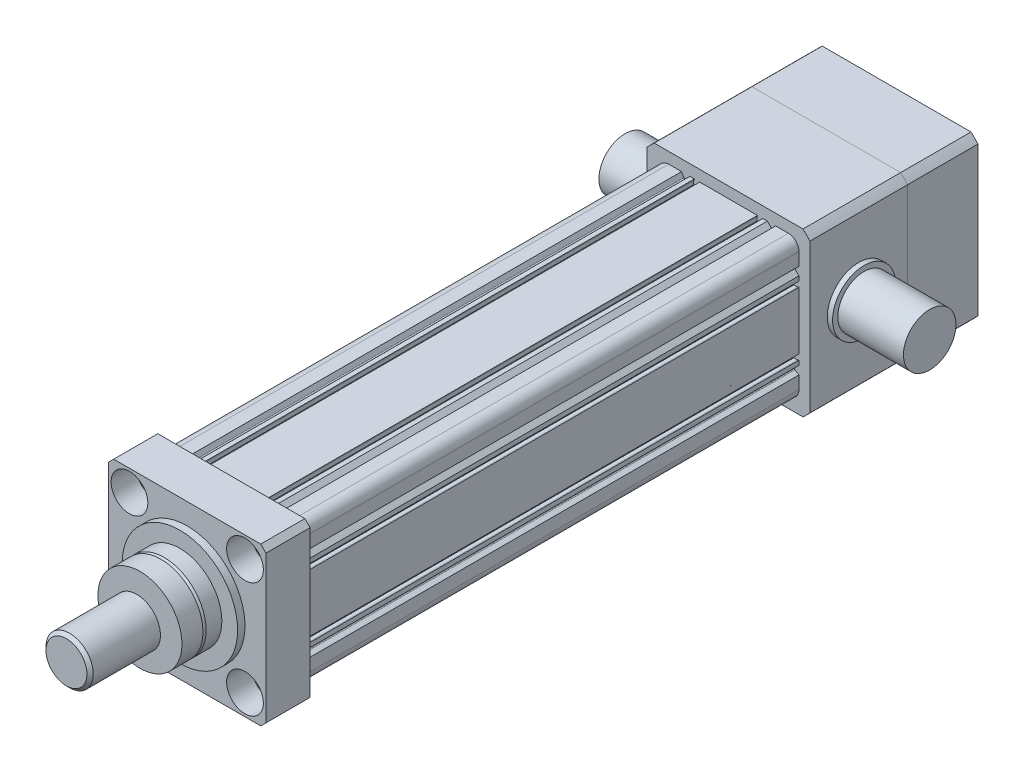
from build123d import *

# Parameters (mm, degrees)
SKETCH_1_R          = 6
EXTRUDE_1_DEPTH     = 473.5
EXTRUDE_1_2_DEPTH   = 42
SKETCH_3_R          = 6.5
SKETCH_3_R_2        = 8.5
CUT_EXTRUDE_1_DEPTH = 42
SKETCH_3_3_R        = 17.5
SKETCH_3_3_R_2      = 8.5
CUT_EXTRUDE_2_DEPTH = 24
SKETCH_3_4_R        = 55
EXTRUDE_2_DEPTH     = 7
SKETCH_4_R          = 40
EXTRUDE_3_DEPTH     = 18
CHAMFER_1_SIZE      = 3
CHAMFER_1_SIZE2     = 1.091910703
SKETCH_5_R          = 40
EXTRUDE_4_DEPTH     = 20
SKETCH_6_R          = 16.5
EXTRUDE_5_DEPTH     = 3
SKETCH_7_R          = 22.5
EXTRUDE_6_DEPTH     = 67
FILLET_1_R          = 1
CHAMFER_2_SIZE      = 3
EXTRUDE_7_DEPTH     = 93
EXTRUDE_8_DEPTH     = 67
SKETCH_10_R         = 65
CUT_EXTRUDE_3_DEPTH = 19
SKETCH_11_R         = 47
CUT_EXTRUDE_4_DEPTH = 47
SKETCH_12_R         = 25
EXTRUDE_9_DEPTH     = 67.5
EXTRUDE_START       = -222.5
SKETCH_12_2_R       = 25
EXTRUDE_10_DEPTH    = 67.5
SKETCH_13_R         = 30
SKETCH_13_R_2       = 25
EXTRUDE_11_DEPTH    = 5
EXTRUDE_START_2     = -160
SKETCH_13_2_R       = 30
SKETCH_13_2_R_2     = 25
EXTRUDE_12_DEPTH    = 5


with BuildPart() as part:
    # Sketch 1 → Extrude 1 (new body)
    with BuildSketch(Plane.XY):
        with BuildLine():
            Line((57, 67), (44.8, 67))
            Line((44.8, 67), (42.56486134, 63.12862628))
            ThreePointArc((42.56486134, 63.12862628), (41.829362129, 62.637181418), (40.991729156, 62.921519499))
            Line((40.991729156, 62.921519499), (36.913248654, 67))
            Line((36.913248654, 67), (32.6, 67))
            Line((32.6, 67), (32.6, 66.1))
            Line((32.6, 66.1), (33.2, 65.5))
            Line((33.2, 65.5), (33.2, 62))
            Line((33.2, 62), (26.9, 62))
            Line((26.9, 62), (26.9, 65.5))
            Line((26.9, 65.5), (27.5, 66.1))
            Line((27.5, 66.1), (27.5, 67))
            Line((27.5, 67), (0, 67))
            Line((0, 67), (-27.5, 67))
            Line((-27.5, 67), (-27.5, 66.1))
            Line((-27.5, 66.1), (-26.9, 65.5))
            Line((-26.9, 65.5), (-26.9, 62))
            Line((-26.9, 62), (-33.2, 62))
            Line((-33.2, 62), (-33.2, 65.5))
            Line((-33.2, 65.5), (-32.6, 66.1))
            Line((-32.6, 66.1), (-32.6, 67))
            Line((-32.6, 67), (-36.913248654, 67))
            Line((-36.913248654, 67), (-40.991729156, 62.921519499))
            ThreePointArc((-40.991729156, 62.921519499), (-41.829362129, 62.637181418), (-42.56486134, 63.12862628))
            Line((-42.56486134, 63.12862628), (-44.8, 67))
            Line((-44.8, 67), (-57, 67))
            ThreePointArc((-57, 67), (-64.071067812, 64.071067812), (-67, 57))
            Line((-67, 57), (-67, 44.8))
            Line((-67, 44.8), (-63.12862628, 42.56486134))
            ThreePointArc((-63.12862628, 42.56486134), (-62.637181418, 41.829362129), (-62.921519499, 40.991729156))
            Line((-62.921519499, 40.991729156), (-67, 36.913248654))
            Line((-67, 36.913248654), (-67, 32.6))
            Line((-67, 32.6), (-66.1, 32.6))
            Line((-66.1, 32.6), (-65.5, 33.2))
            Line((-65.5, 33.2), (-62, 33.2))
            Line((-62, 33.2), (-62, 26.9))
            Line((-62, 26.9), (-65.5, 26.9))
            Line((-65.5, 26.9), (-66.1, 27.5))
            Line((-66.1, 27.5), (-67, 27.5))
            Line((-67, 27.5), (-67, 0))
            Line((-67, 0), (-67, -27.5))
            Line((-67, -27.5), (-66.1, -27.5))
            Line((-66.1, -27.5), (-65.5, -26.9))
            Line((-65.5, -26.9), (-62, -26.9))
            Line((-62, -26.9), (-62, -33.2))
            Line((-62, -33.2), (-65.5, -33.2))
            Line((-65.5, -33.2), (-66.1, -32.6))
            Line((-66.1, -32.6), (-67, -32.6))
            Line((-67, -32.6), (-67, -36.913248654))
            Line((-67, -36.913248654), (-62.921519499, -40.991729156))
            ThreePointArc((-62.921519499, -40.991729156), (-62.637181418, -41.829362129), (-63.12862628, -42.56486134))
            Line((-63.12862628, -42.56486134), (-67, -44.8))
            Line((-67, -44.8), (-67, -57))
            ThreePointArc((-67, -57), (-64.071067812, -64.071067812), (-57, -67))
            Line((-57, -67), (-44.8, -67))
            Line((-44.8, -67), (-42.56486134, -63.12862628))
            ThreePointArc((-42.56486134, -63.12862628), (-41.829362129, -62.637181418), (-40.991729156, -62.921519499))
            Line((-40.991729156, -62.921519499), (-36.913248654, -67))
            Line((-36.913248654, -67), (36.913248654, -67))
            Line((36.913248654, -67), (40.991729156, -62.921519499))
            ThreePointArc((40.991729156, -62.921519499), (41.829362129, -62.637181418), (42.56486134, -63.12862628))
            Line((42.56486134, -63.12862628), (44.8, -67))
            Line((44.8, -67), (57, -67))
            ThreePointArc((57, -67), (64.071067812, -64.071067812), (67, -57))
            Line((67, -57), (67, -44.8))
            Line((67, -44.8), (63.12862628, -42.56486134))
            ThreePointArc((63.12862628, -42.56486134), (62.637181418, -41.829362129), (62.921519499, -40.991729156))
            Line((62.921519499, -40.991729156), (67, -36.913248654))
            Line((67, -36.913248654), (67, -32.6))
            Line((67, -32.6), (66.1, -32.6))
            Line((66.1, -32.6), (65.5, -33.2))
            Line((65.5, -33.2), (62, -33.2))
            Line((62, -33.2), (62, -26.9))
            Line((62, -26.9), (65.5, -26.9))
            Line((65.5, -26.9), (66.1, -27.5))
            Line((66.1, -27.5), (67, -27.5))
            Line((67, -27.5), (67, 0))
            Line((67, 0), (67, 27.5))
            Line((67, 27.5), (66.1, 27.5))
            Line((66.1, 27.5), (65.5, 26.9))
            Line((65.5, 26.9), (62, 26.9))
            Line((62, 26.9), (62, 33.2))
            Line((62, 33.2), (65.5, 33.2))
            Line((65.5, 33.2), (66.1, 32.6))
            Line((66.1, 32.6), (67, 32.6))
            Line((67, 32.6), (67, 36.913248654))
            Line((67, 36.913248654), (62.921519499, 40.991729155))
            ThreePointArc((62.921519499, 40.991729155), (62.637181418, 41.829362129), (63.12862628, 42.56486134))
            Line((63.12862628, 42.56486134), (67, 44.8))
            Line((67, 44.8), (67, 57))
            ThreePointArc((67, 57), (64.071067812, 64.071067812), (57, 67))
        make_face()
        with Locations((-55, 55)):
            Circle(SKETCH_1_R, mode=Mode.SUBTRACT)
        with Locations((55, 55)):
            Circle(SKETCH_1_R, mode=Mode.SUBTRACT)
        with Locations((-55, -55)):
            Circle(SKETCH_1_R, mode=Mode.SUBTRACT)
        with Locations((55, -55)):
            Circle(SKETCH_1_R, mode=Mode.SUBTRACT)
        with BuildLine():
            Line((41.774779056, 51.785063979), (43.601329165, 54.94874157))
            ThreePointArc((43.601329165, 54.94874157), (43.701229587, 55.707560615), (43.235303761, 56.314766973))
            Line((43.235303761, 56.314766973), (39.616756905, 58.403935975))
            ThreePointArc((39.616756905, 58.403935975), (39.337726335, 58.513191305), (39.038853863, 58.534871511))
            Line((39.038853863, 58.534871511), (35.747329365, 58.277670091))
            ThreePointArc((35.747329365, 58.277670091), (35.481311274, 58.1068038), (35.28193171, 57.86142918))
            Line((35.28193171, 57.86142918), (34.274000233, 56.115640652))
            ThreePointArc((34.274000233, 56.115640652), (34.174099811, 55.356821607), (34.640025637, 54.749615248))
            Line((34.640025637, 54.749615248), (40.408753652, 51.419038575))
            ThreePointArc((40.408753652, 51.419038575), (41.167572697, 51.319138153), (41.774779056, 51.785063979))
        make_face(mode=Mode.SUBTRACT)
        with BuildLine():
            Line((51.785063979, 41.774779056), (54.94874157, 43.601329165))
            ThreePointArc((54.94874157, 43.601329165), (55.707560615, 43.701229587), (56.314766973, 43.235303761))
            Line((56.314766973, 43.235303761), (58.403935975, 39.616756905))
            ThreePointArc((58.403935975, 39.616756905), (58.513191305, 39.337726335), (58.534871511, 39.038853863))
            Line((58.534871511, 39.038853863), (58.277670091, 35.747329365))
            ThreePointArc((58.277670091, 35.747329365), (58.1068038, 35.481311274), (57.86142918, 35.28193171))
            Line((57.86142918, 35.28193171), (56.115640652, 34.274000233))
            ThreePointArc((56.115640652, 34.274000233), (55.356821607, 34.174099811), (54.749615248, 34.640025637))
            Line((54.749615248, 34.640025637), (51.419038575, 40.408753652))
            ThreePointArc((51.419038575, 40.408753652), (51.319138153, 41.167572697), (51.785063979, 41.774779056))
        make_face(mode=Mode.SUBTRACT)
        with BuildLine():
            Line((-57.86142918, 35.28193171), (-56.115640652, 34.274000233))
            ThreePointArc((-56.115640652, 34.274000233), (-55.356821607, 34.174099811), (-54.749615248, 34.640025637))
            Line((-54.749615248, 34.640025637), (-51.419038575, 40.408753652))
            ThreePointArc((-51.419038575, 40.408753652), (-51.319138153, 41.167572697), (-51.785063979, 41.774779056))
            Line((-51.785063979, 41.774779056), (-54.94874157, 43.601329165))
            ThreePointArc((-54.94874157, 43.601329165), (-55.707560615, 43.701229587), (-56.314766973, 43.235303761))
            Line((-56.314766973, 43.235303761), (-58.403935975, 39.616756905))
            ThreePointArc((-58.403935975, 39.616756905), (-58.513191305, 39.337726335), (-58.534871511, 39.038853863))
            Line((-58.534871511, 39.038853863), (-58.277670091, 35.747329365))
            ThreePointArc((-58.277670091, 35.747329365), (-58.1068038, 35.481311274), (-57.86142918, 35.28193171))
        make_face(mode=Mode.SUBTRACT)
        with BuildLine():
            Line((-33.360371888, -64.600232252), (-19.423193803, -64.600232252))
            ThreePointArc((-19.423193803, -64.600232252), (-18.434155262, -63.747889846), (-19.1311157, -62.643837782))
            ThreePointArc((-19.1311157, -62.643837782), (-26.690004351, -59.815496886), (-33.843674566, -56.079012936))
            ThreePointArc((-33.843674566, -56.079012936), (-34.851952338, -56.064348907), (-35.360371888, -56.935181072))
            Line((-35.360371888, -56.935181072), (-35.360371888, -62.600232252))
            Line((-35.360371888, -62.600232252), (-33.360371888, -64.600232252))
        make_face(mode=Mode.SUBTRACT)
        with BuildLine():
            Line((35.360371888, -62.600232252), (33.360371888, -64.600232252))
            Line((33.360371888, -64.600232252), (19.423193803, -64.600232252))
            ThreePointArc((19.423193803, -64.600232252), (18.434155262, -63.747889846), (19.1311157, -62.643837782))
            ThreePointArc((19.1311157, -62.643837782), (26.690004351, -59.815496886), (33.843674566, -56.079012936))
            ThreePointArc((33.843674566, -56.079012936), (34.851952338, -56.064348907), (35.360371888, -56.935181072))
            Line((35.360371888, -56.935181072), (35.360371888, -62.600232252))
        make_face(mode=Mode.SUBTRACT)
        with BuildLine():
            Line((51.785063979, -41.774779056), (54.94874157, -43.601329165))
            ThreePointArc((54.94874157, -43.601329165), (55.707560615, -43.701229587), (56.314766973, -43.235303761))
            Line((56.314766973, -43.235303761), (58.403935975, -39.616756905))
            ThreePointArc((58.403935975, -39.616756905), (58.513191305, -39.337726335), (58.534871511, -39.038853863))
            Line((58.534871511, -39.038853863), (58.277670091, -35.747329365))
            ThreePointArc((58.277670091, -35.747329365), (58.1068038, -35.481311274), (57.86142918, -35.28193171))
            Line((57.86142918, -35.28193171), (56.115640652, -34.274000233))
            ThreePointArc((56.115640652, -34.274000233), (55.356821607, -34.174099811), (54.749615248, -34.640025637))
            Line((54.749615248, -34.640025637), (51.419038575, -40.408753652))
            ThreePointArc((51.419038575, -40.408753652), (51.319138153, -41.167572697), (51.785063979, -41.774779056))
        make_face(mode=Mode.SUBTRACT)
        with BuildLine():
            Line((-57.86142918, -35.28193171), (-56.115640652, -34.274000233))
            ThreePointArc((-56.115640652, -34.274000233), (-55.356821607, -34.174099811), (-54.749615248, -34.640025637))
            Line((-54.749615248, -34.640025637), (-51.419038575, -40.408753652))
            ThreePointArc((-51.419038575, -40.408753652), (-51.319138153, -41.167572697), (-51.785063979, -41.774779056))
            Line((-51.785063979, -41.774779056), (-54.94874157, -43.601329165))
            ThreePointArc((-54.94874157, -43.601329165), (-55.707560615, -43.701229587), (-56.314766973, -43.235303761))
            Line((-56.314766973, -43.235303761), (-58.403935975, -39.616756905))
            ThreePointArc((-58.403935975, -39.616756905), (-58.513191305, -39.337726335), (-58.534871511, -39.038853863))
            Line((-58.534871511, -39.038853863), (-58.277670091, -35.747329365))
            ThreePointArc((-58.277670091, -35.747329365), (-58.1068038, -35.481311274), (-57.86142918, -35.28193171))
        make_face(mode=Mode.SUBTRACT)
        with BuildLine():
            Line((-41.774779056, 51.785063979), (-43.601329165, 54.94874157))
            ThreePointArc((-43.601329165, 54.94874157), (-43.701229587, 55.707560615), (-43.235303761, 56.314766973))
            Line((-43.235303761, 56.314766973), (-39.616756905, 58.403935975))
            ThreePointArc((-39.616756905, 58.403935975), (-39.337726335, 58.513191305), (-39.038853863, 58.534871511))
            Line((-39.038853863, 58.534871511), (-35.747329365, 58.277670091))
            ThreePointArc((-35.747329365, 58.277670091), (-35.481311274, 58.1068038), (-35.28193171, 57.86142918))
            Line((-35.28193171, 57.86142918), (-34.274000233, 56.115640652))
            ThreePointArc((-34.274000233, 56.115640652), (-34.174099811, 55.356821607), (-34.640025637, 54.749615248))
            Line((-34.640025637, 54.749615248), (-40.408753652, 51.419038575))
            ThreePointArc((-40.408753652, 51.419038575), (-41.167572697, 51.319138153), (-41.774779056, 51.785063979))
        make_face(mode=Mode.SUBTRACT)
        with BuildLine():
            ThreePointArc((62.5, 0), (0, 62.5), (-62.5, 0))
            ThreePointArc((-62.5, 0), (0, -62.5), (62.5, 0))
        make_face(mode=Mode.SUBTRACT)
    extrude(amount=EXTRUDE_1_DEPTH)

    # Sketch 2 → Extrude 1 2 (add)
    with BuildSketch(Plane.XY.offset(473.5)):
        Polygon((-75, 70), (-70, 75), (70, 75), (75, 70), (75, -70), (70, -75), (-70, -75), (-75, -70), align=None)
    extrude(amount=EXTRUDE_1_2_DEPTH)

    # Sketch 3 → Cut-Extrude 1 (cut)
    with BuildSketch(Plane.XY.offset(515.5)):
        with Locations((-85, 20)):
            Circle(SKETCH_3_R)
        with Locations((-85, -20)):
            Circle(SKETCH_3_R)
        with Locations((-85, -60)):
            Circle(SKETCH_3_R)
        with Locations((-55, -55)):
            Circle(SKETCH_3_R_2)
        with Locations((-55, 55)):
            Circle(SKETCH_3_R_2)
        with Locations((55, 55)):
            Circle(SKETCH_3_R_2)
        with Locations((85, 60)):
            Circle(SKETCH_3_R)
        with Locations((85, 20)):
            Circle(SKETCH_3_R)
        with Locations((85, -20)):
            Circle(SKETCH_3_R)
        with Locations((85, -60)):
            Circle(SKETCH_3_R)
        with Locations((55, -55)):
            Circle(SKETCH_3_R_2)
        with Locations((-85, 60)):
            Circle(SKETCH_3_R)
    extrude(amount=-CUT_EXTRUDE_1_DEPTH, mode=Mode.SUBTRACT)

    # Sketch 3_3 → Cut-Extrude 2 (cut)
    # profile 1 of 4: a face of its own
    with BuildSketch(Plane.XY.offset(515.5)):
        with Locations((55, 55)):
            Circle(SKETCH_3_3_R)
        with Locations((55, 55)):
            Circle(SKETCH_3_3_R_2, mode=Mode.SUBTRACT)
    # profile 2 of 4: a face of its own
    with BuildSketch(Plane.XY.offset(515.5)):
        with Locations((55, -55)):
            Circle(SKETCH_3_3_R)
        with Locations((55, -55)):
            Circle(SKETCH_3_3_R_2, mode=Mode.SUBTRACT)
    # profile 3 of 4: a face of its own
    with BuildSketch(Plane.XY.offset(515.5)):
        with Locations((-55, -55)):
            Circle(SKETCH_3_3_R)
        with Locations((-55, -55)):
            Circle(SKETCH_3_3_R_2, mode=Mode.SUBTRACT)
    # profile 4 of 4: a face of its own
    with BuildSketch(Plane.XY.offset(515.5)):
        with Locations((-55, 55)):
            Circle(SKETCH_3_3_R)
    extrude(amount=-CUT_EXTRUDE_2_DEPTH, mode=Mode.SUBTRACT)

    # Sketch 3_4 → Extrude 2 (add)
    with BuildSketch(Plane.XY.offset(515.5)):
        with Locations(Location((0, 0, 0), (0, 0, 180))):
            Circle(SKETCH_3_4_R)
    extrude(amount=EXTRUDE_2_DEPTH)

    # Sketch 4 → Extrude 3 (add)
    with BuildSketch(Plane.XY.offset(522.5)):
        Circle(SKETCH_4_R)
    extrude(amount=EXTRUDE_3_DEPTH)

    # Chamfer 1
    chamfer_1_edges = [part.edges().sort_by_distance(p)[0] for p in [
        (-40, 0, 540.5),
    ]]
    chamfer_1_side = [part.faces().sort_by_distance(p)[0] for p in [
        (-40, 0, 531.5),
    ]]
    chamfer(chamfer_1_edges, length=CHAMFER_1_SIZE, length2=CHAMFER_1_SIZE2, reference=chamfer_1_side[0])

    # Sketch 5 → Extrude 4 (add)
    with BuildSketch(Plane.XY.offset(540.5)):
        Circle(SKETCH_5_R)
    extrude(amount=EXTRUDE_4_DEPTH)

    # Sketch 6 → Extrude 5 (add)
    with BuildSketch(Plane.XY.offset(560.5)):
        Circle(SKETCH_6_R)
    extrude(amount=EXTRUDE_5_DEPTH)

    # Sketch 7 → Extrude 6 (add)
    with BuildSketch(Plane.XY.offset(563.5)):
        Circle(SKETCH_7_R)
    extrude(amount=EXTRUDE_6_DEPTH)

    # Fillet 1
    fillet_1_edges = [part.edges().sort_by_distance(p)[0] for p in [
        (-16.5, 0, 560.5),
    ]]
    fillet(fillet_1_edges, radius=FILLET_1_R)

    # Chamfer 2
    chamfer_2_edges = [part.edges().sort_by_distance(p)[0] for p in [
        (-22.5, 0, 630.5),
    ]]
    chamfer(chamfer_2_edges, length=CHAMFER_2_SIZE)

    # Sketch 8 → Extrude 7 (add)
    with BuildSketch(Plane(origin=(0, 0, 0), x_dir=(-1, 0, 0), z_dir=(0, 0, -1))):
        with BuildLine():
            Line((-70.843136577, 77.5), (70.843136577, 77.5))
            ThreePointArc((70.843136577, 77.5), (74.246212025, 74.246212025), (77.5, 70.843136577))
            Line((77.5, 70.843136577), (77.5, -70.843136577))
            ThreePointArc((77.5, -70.843136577), (74.246212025, -74.246212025), (70.843136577, -77.5))
            Line((70.843136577, -77.5), (-70.843136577, -77.5))
            ThreePointArc((-70.843136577, -77.5), (-74.246212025, -74.246212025), (-77.5, -70.843136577))
            Line((-77.5, -70.843136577), (-77.5, 70.843136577))
            ThreePointArc((-77.5, 70.843136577), (-74.246212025, 74.246212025), (-70.843136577, 77.5))
        make_face()
    extrude(amount=EXTRUDE_7_DEPTH)

    # Sketch 12 → Extrude 9 (add)
    with BuildSketch(Plane.ZY.offset(77.5)):
        with Locations(Location((-46.5, 0, 0), (0, 0, 270))):
            Circle(SKETCH_12_R)
    extrude(amount=EXTRUDE_9_DEPTH)

    # Sketch 12_2 → Extrude 10 (add)
    with BuildSketch(Plane.ZY.offset(77.5).offset(EXTRUDE_START)):
        with Locations(Location((-46.5, 0, 0), (0, 0, 270))):
            Circle(SKETCH_12_2_R)
    extrude(amount=EXTRUDE_10_DEPTH)

    # Sketch 13 → Extrude 11 (add)
    with BuildSketch(Plane.ZY.offset(77.5)):
        with Locations(Location((-46.5, 0, 0), (0, 0, 90))):
            Circle(SKETCH_13_R)
        with Locations(Location((-46.5, 0, 0), (0, 0, 270))):
            Circle(SKETCH_13_R_2, mode=Mode.SUBTRACT)
    extrude(amount=EXTRUDE_11_DEPTH)

    # Sketch 13_2 → Extrude 12 (add)
    with BuildSketch(Plane.ZY.offset(77.5).offset(EXTRUDE_START_2)):
        with Locations(Location((-46.5, 0, 0), (0, 0, 90))):
            Circle(SKETCH_13_2_R)
        with Locations(Location((-46.5, 0, 0), (0, 0, 270))):
            Circle(SKETCH_13_2_R_2, mode=Mode.SUBTRACT)
    extrude(amount=EXTRUDE_12_DEPTH)


with BuildPart() as body_2:
    # Sketch 9 → Extrude 8 (new body)
    with BuildSketch(Plane(origin=(0, 0, -93), x_dir=(-1, 0, 0), z_dir=(0, 0, -1))):
        with BuildLine():
            Line((-70.843136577, 77.5), (70.843136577, 77.5))
            ThreePointArc((70.843136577, 77.5), (74.246212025, 74.246212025), (77.5, 70.843136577))
            Line((77.5, 70.843136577), (77.5, -70.843136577))
            ThreePointArc((77.5, -70.843136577), (74.246212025, -74.246212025), (70.843136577, -77.5))
            Line((70.843136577, -77.5), (-70.843136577, -77.5))
            ThreePointArc((-70.843136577, -77.5), (-74.246212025, -74.246212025), (-77.5, -70.843136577))
            Line((-77.5, -70.843136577), (-77.5, 70.843136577))
            ThreePointArc((-77.5, 70.843136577), (-74.246212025, 74.246212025), (-70.843136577, 77.5))
        make_face()
    extrude(amount=EXTRUDE_8_DEPTH)

    # Sketch 10 → Cut-Extrude 3 (cut)
    with BuildSketch(Plane(origin=(0, 0, -160), x_dir=(-1, 0, 0), z_dir=(0, 0, -1))):
        Circle(SKETCH_10_R)
    extrude(amount=-CUT_EXTRUDE_3_DEPTH, mode=Mode.SUBTRACT)

    # Sketch 11 → Cut-Extrude 4 (cut)
    with BuildSketch(Plane(origin=(0, 0, -141), x_dir=(-1, 0, 0), z_dir=(0, 0, -1))):
        Circle(SKETCH_11_R)
    extrude(amount=-CUT_EXTRUDE_4_DEPTH, mode=Mode.SUBTRACT)


solid = Compound([part.part, body_2.part])
